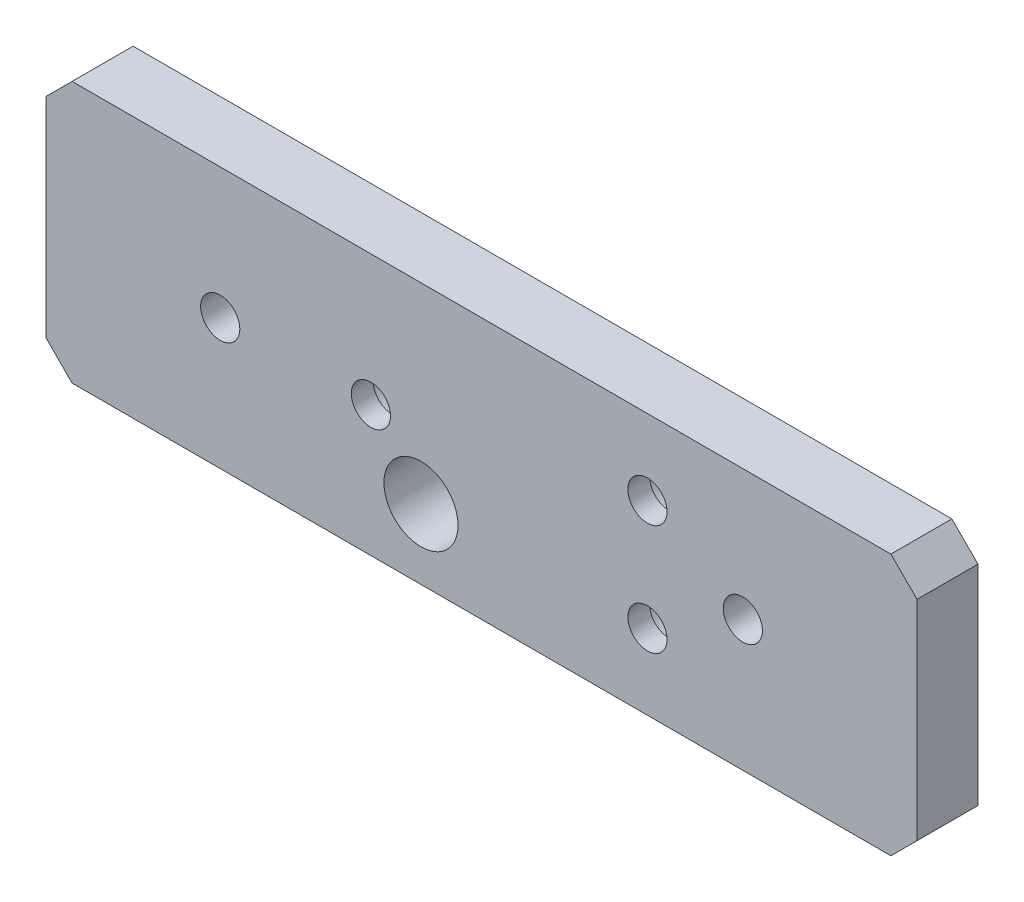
ISO-10303-21;
HEADER;
FILE_DESCRIPTION(('STEP AP214'),'2;1');
FILE_NAME('part.step','',(''),(''),'','','');
FILE_SCHEMA(('AUTOMOTIVE_DESIGN { 1 0 10303 214 1 1 1 1 }'));
ENDSEC;
DATA;
#1=APPLICATION_CONTEXT('core data for automotive mechanical design processes');
#2=APPLICATION_PROTOCOL_DEFINITION('international standard','automotive_design',2000,#1);
#3=PRODUCT_CONTEXT('',#1,'mechanical');
#4=PRODUCT('Part','Part','',(#3));
#5=PRODUCT_RELATED_PRODUCT_CATEGORY('part','',(#4));
#6=PRODUCT_DEFINITION_FORMATION('','',#4);
#7=PRODUCT_DEFINITION_CONTEXT('part definition',#1,'design');
#8=PRODUCT_DEFINITION('design','',#6,#7);
#9=PRODUCT_DEFINITION_SHAPE('','',#8);
#10=(LENGTH_UNIT() NAMED_UNIT(*) SI_UNIT(.MILLI.,.METRE.));
#11=(NAMED_UNIT(*) PLANE_ANGLE_UNIT() SI_UNIT($,.RADIAN.));
#12=(NAMED_UNIT(*) SI_UNIT($,.STERADIAN.) SOLID_ANGLE_UNIT());
#13=UNCERTAINTY_MEASURE_WITH_UNIT(LENGTH_MEASURE(1.E-05),#10,'distance_accuracy_value','');
#14=(GEOMETRIC_REPRESENTATION_CONTEXT(3) GLOBAL_UNCERTAINTY_ASSIGNED_CONTEXT((#13)) GLOBAL_UNIT_ASSIGNED_CONTEXT((#10,
#11,#12)) REPRESENTATION_CONTEXT('',''));
#15=CARTESIAN_POINT('',(0.,0.,0.));
#16=DIRECTION('',(0.,0.,1.));
#17=DIRECTION('',(1.,0.,0.));
#18=AXIS2_PLACEMENT_3D('',#15,#16,#17);
#19=CARTESIAN_POINT('',(91.2999999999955,-25.0000000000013,10.000000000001));
#20=DIRECTION('',(0.,0.,-1.));
#21=DIRECTION('',(-1.,0.,0.));
#22=AXIS2_PLACEMENT_3D('',#19,#20,#21);
#23=CYLINDRICAL_SURFACE('',#22,2.25);
#24=CARTESIAN_POINT('',(91.2999999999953,-25.0000000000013,7.00000000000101));
#25=DIRECTION('',(0.,0.,1.));
#26=DIRECTION('',(1.,0.,0.));
#27=AXIS2_PLACEMENT_3D('',#24,#25,#26);
#28=CIRCLE('',#27,2.25);
#29=CARTESIAN_POINT('',(93.5499999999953,-25.0000000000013,7.00000000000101));
#30=VERTEX_POINT('',#29);
#31=EDGE_CURVE('E145',#30,#30,#28,.T.);
#32=ORIENTED_EDGE('',*,*,#31,.T.);
#33=EDGE_LOOP('',(#32));
#34=FACE_BOUND('',#33,.T.);
#35=CARTESIAN_POINT('',(91.2999999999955,-25.0000000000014,4.50000000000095));
#36=DIRECTION('',(0.,0.,-1.));
#37=DIRECTION('',(-1.,0.,0.));
#38=AXIS2_PLACEMENT_3D('',#35,#36,#37);
#39=CIRCLE('',#38,2.25);
#40=CARTESIAN_POINT('',(89.0499999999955,-25.0000000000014,4.50000000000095));
#41=VERTEX_POINT('',#40);
#42=EDGE_CURVE('E143',#41,#41,#39,.F.);
#43=ORIENTED_EDGE('',*,*,#42,.F.);
#44=EDGE_LOOP('',(#43));
#45=FACE_BOUND('',#44,.T.);
#46=ADVANCED_FACE('F36',(#34,#45),#23,.F.);
#47=CARTESIAN_POINT('',(123.049999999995,-31.3500000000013,10.0000000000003));
#48=DIRECTION('',(0.,0.,-1.));
#49=DIRECTION('',(-1.,0.,0.));
#50=AXIS2_PLACEMENT_3D('',#47,#48,#49);
#51=CYLINDRICAL_SURFACE('',#50,2.25);
#52=CARTESIAN_POINT('',(123.049999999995,-31.3500000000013,7.00000000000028));
#53=DIRECTION('',(0.,0.,1.));
#54=DIRECTION('',(1.,0.,0.));
#55=AXIS2_PLACEMENT_3D('',#52,#53,#54);
#56=CIRCLE('',#55,2.25);
#57=CARTESIAN_POINT('',(125.299999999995,-31.3500000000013,7.00000000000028));
#58=VERTEX_POINT('',#57);
#59=EDGE_CURVE('E204',#58,#58,#56,.T.);
#60=ORIENTED_EDGE('',*,*,#59,.T.);
#61=EDGE_LOOP('',(#60));
#62=FACE_BOUND('',#61,.T.);
#63=CARTESIAN_POINT('',(123.049999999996,-31.3500000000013,4.50000000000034));
#64=DIRECTION('',(0.,0.,-1.));
#65=DIRECTION('',(-1.,0.,0.));
#66=AXIS2_PLACEMENT_3D('',#63,#64,#65);
#67=CIRCLE('',#66,2.25);
#68=CARTESIAN_POINT('',(120.799999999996,-31.3500000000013,4.50000000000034));
#69=VERTEX_POINT('',#68);
#70=EDGE_CURVE('E139',#69,#69,#67,.F.);
#71=ORIENTED_EDGE('',*,*,#70,.F.);
#72=EDGE_LOOP('',(#71));
#73=FACE_BOUND('',#72,.T.);
#74=ADVANCED_FACE('F239',(#62,#73),#51,.F.);
#75=CARTESIAN_POINT('',(123.049999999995,-18.6500000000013,10.000000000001));
#76=DIRECTION('',(0.,0.,-1.));
#77=DIRECTION('',(-1.,0.,0.));
#78=AXIS2_PLACEMENT_3D('',#75,#76,#77);
#79=CYLINDRICAL_SURFACE('',#78,2.25);
#80=CARTESIAN_POINT('',(123.049999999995,-18.6500000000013,7.00000000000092));
#81=DIRECTION('',(0.,0.,1.));
#82=DIRECTION('',(1.,0.,0.));
#83=AXIS2_PLACEMENT_3D('',#80,#81,#82);
#84=CIRCLE('',#83,2.25);
#85=CARTESIAN_POINT('',(125.299999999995,-18.6500000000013,7.00000000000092));
#86=VERTEX_POINT('',#85);
#87=EDGE_CURVE('E207',#86,#86,#84,.T.);
#88=ORIENTED_EDGE('',*,*,#87,.T.);
#89=EDGE_LOOP('',(#88));
#90=FACE_BOUND('',#89,.T.);
#91=CARTESIAN_POINT('',(123.049999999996,-18.6500000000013,4.50000000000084));
#92=DIRECTION('',(0.,0.,-1.));
#93=DIRECTION('',(-1.,0.,0.));
#94=AXIS2_PLACEMENT_3D('',#91,#92,#93);
#95=CIRCLE('',#94,2.25);
#96=CARTESIAN_POINT('',(120.799999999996,-18.6500000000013,4.50000000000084));
#97=VERTEX_POINT('',#96);
#98=EDGE_CURVE('E136',#97,#97,#95,.F.);
#99=ORIENTED_EDGE('',*,*,#98,.F.);
#100=EDGE_LOOP('',(#99));
#101=FACE_BOUND('',#100,.T.);
#102=ADVANCED_FACE('F232',(#90,#101),#79,.F.);
#103=CARTESIAN_POINT('',(164.000000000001,-40.0000000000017,7.00000000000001));
#104=DIRECTION('',(0.,1.,0.));
#105=DIRECTION('',(0.,0.,1.));
#106=AXIS2_PLACEMENT_3D('',#103,#104,#105);
#107=PLANE('',#106);
#108=DIRECTION('',(1.,0.,0.));
#109=VECTOR('',#108,1.);
#110=CARTESIAN_POINT('',(164.000000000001,-40.0000000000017,7.00000000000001));
#111=LINE('',#110,#109);
#112=CARTESIAN_POINT('',(57.0000000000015,-40.0000000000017,7.00000000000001));
#113=VERTEX_POINT('',#112);
#114=CARTESIAN_POINT('',(151.000000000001,-40.0000000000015,7.00000000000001));
#115=VERTEX_POINT('',#114);
#116=EDGE_CURVE('E118',#113,#115,#111,.T.);
#117=ORIENTED_EDGE('',*,*,#116,.F.);
#118=DIRECTION('',(0.,0.,-1.));
#119=VECTOR('',#118,1.);
#120=CARTESIAN_POINT('',(57.0000000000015,-40.0000000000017,7.00000000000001));
#121=LINE('',#120,#119);
#122=CARTESIAN_POINT('',(57.0000000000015,-40.0000000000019,0.));
#123=VERTEX_POINT('',#122);
#124=EDGE_CURVE('E165',#113,#123,#121,.T.);
#125=ORIENTED_EDGE('',*,*,#124,.T.);
#126=DIRECTION('',(1.,0.,0.));
#127=VECTOR('',#126,1.);
#128=CARTESIAN_POINT('',(164.000000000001,-40.0000000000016,0.));
#129=LINE('',#128,#127);
#130=CARTESIAN_POINT('',(151.000000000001,-40.0000000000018,0.));
#131=VERTEX_POINT('',#130);
#132=EDGE_CURVE('E126',#123,#131,#129,.T.);
#133=ORIENTED_EDGE('',*,*,#132,.T.);
#134=DIRECTION('',(0.,0.,1.));
#135=VECTOR('',#134,1.);
#136=CARTESIAN_POINT('',(151.000000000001,-40.0000000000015,7.00000000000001));
#137=LINE('',#136,#135);
#138=EDGE_CURVE('E163',#131,#115,#137,.T.);
#139=ORIENTED_EDGE('',*,*,#138,.T.);
#140=EDGE_LOOP('',(#117,#125,#133,#139));
#141=FACE_BOUND('',#140,.T.);
#142=ADVANCED_FACE('F223',(#141),#107,.F.);
#143=CARTESIAN_POINT('',(0.,2.63677968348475E-13,7.00000000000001));
#144=DIRECTION('',(0.,0.,1.));
#145=DIRECTION('',(1.,0.,0.));
#146=AXIS2_PLACEMENT_3D('',#143,#144,#145);
#147=PLANE('',#146);
#148=CARTESIAN_POINT('',(97.0499999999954,-32.0000000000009,6.9999999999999));
#149=DIRECTION('',(0.,0.,1.));
#150=DIRECTION('',(1.,0.,0.));
#151=AXIS2_PLACEMENT_3D('',#148,#149,#150);
#152=CIRCLE('',#151,4.25);
#153=CARTESIAN_POINT('',(101.299999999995,-32.0000000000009,6.9999999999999));
#154=VERTEX_POINT('',#153);
#155=EDGE_CURVE('E175',#154,#154,#152,.T.);
#156=ORIENTED_EDGE('',*,*,#155,.F.);
#157=EDGE_LOOP('',(#156));
#158=FACE_BOUND('',#157,.T.);
#159=DIRECTION('',(-1.,0.,0.));
#160=VECTOR('',#159,1.);
#161=CARTESIAN_POINT('',(164.000000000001,-10.0000000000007,7.00000000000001));
#162=LINE('',#161,#160);
#163=CARTESIAN_POINT('',(151.000000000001,-10.0000000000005,7.00000000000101));
#164=VERTEX_POINT('',#163);
#165=CARTESIAN_POINT('',(57.0000000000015,-10.0000000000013,7.00000000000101));
#166=VERTEX_POINT('',#165);
#167=EDGE_CURVE('E116',#164,#166,#162,.T.);
#168=ORIENTED_EDGE('',*,*,#167,.T.);
#169=DIRECTION('',(0.707106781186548,0.707106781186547,0.));
#170=VECTOR('',#169,1.);
#171=CARTESIAN_POINT('',(33.5000000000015,-33.5000000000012,7.00000000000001));
#172=LINE('',#171,#170);
#173=CARTESIAN_POINT('',(54.0000000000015,-13.0000000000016,7.00000000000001));
#174=VERTEX_POINT('',#173);
#175=EDGE_CURVE('E154',#166,#174,#172,.F.);
#176=ORIENTED_EDGE('',*,*,#175,.T.);
#177=DIRECTION('',(0.,-1.,0.));
#178=VECTOR('',#177,1.);
#179=CARTESIAN_POINT('',(54.0000000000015,11.6718739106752,7.00000000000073));
#180=LINE('',#179,#178);
#181=CARTESIAN_POINT('',(54.0000000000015,-37.0000000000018,7.00000000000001));
#182=VERTEX_POINT('',#181);
#183=EDGE_CURVE('E197',#174,#182,#180,.T.);
#184=ORIENTED_EDGE('',*,*,#183,.T.);
#185=DIRECTION('',(-0.707106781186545,0.70710678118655,0.));
#186=VECTOR('',#185,1.);
#187=CARTESIAN_POINT('',(8.49999999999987,8.5000000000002,7.00000000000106));
#188=LINE('',#187,#186);
#189=EDGE_CURVE('E152',#182,#113,#188,.F.);
#190=ORIENTED_EDGE('',*,*,#189,.T.);
#191=ORIENTED_EDGE('',*,*,#116,.T.);
#192=DIRECTION('',(-0.707106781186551,-0.707106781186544,0.));
#193=VECTOR('',#192,1.);
#194=CARTESIAN_POINT('',(95.5000000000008,-95.500000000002,7.00000000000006));
#195=LINE('',#194,#193);
#196=CARTESIAN_POINT('',(154.000000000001,-37.0000000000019,7.00000000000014));
#197=VERTEX_POINT('',#196);
#198=EDGE_CURVE('E148',#115,#197,#195,.F.);
#199=ORIENTED_EDGE('',*,*,#198,.T.);
#200=DIRECTION('',(0.,1.,0.));
#201=VECTOR('',#200,1.);
#202=CARTESIAN_POINT('',(154.000000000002,-10.0000000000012,7.00000000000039));
#203=LINE('',#202,#201);
#204=CARTESIAN_POINT('',(154.000000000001,-13.0000000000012,7.00000000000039));
#205=VERTEX_POINT('',#204);
#206=EDGE_CURVE('E172',#197,#205,#203,.T.);
#207=ORIENTED_EDGE('',*,*,#206,.T.);
#208=DIRECTION('',(0.707106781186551,-0.707106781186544,0.));
#209=VECTOR('',#208,1.);
#210=CARTESIAN_POINT('',(70.4999999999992,70.5000000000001,7.00000000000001));
#211=LINE('',#210,#209);
#212=EDGE_CURVE('E150',#205,#164,#211,.F.);
#213=ORIENTED_EDGE('',*,*,#212,.T.);
#214=EDGE_LOOP('',(#168,#176,#184,#190,#191,#199,#207,#213));
#215=FACE_BOUND('',#214,.T.);
#216=ORIENTED_EDGE('',*,*,#87,.F.);
#217=EDGE_LOOP('',(#216));
#218=FACE_BOUND('',#217,.T.);
#219=ORIENTED_EDGE('',*,*,#59,.F.);
#220=EDGE_LOOP('',(#219));
#221=FACE_BOUND('',#220,.T.);
#222=ORIENTED_EDGE('',*,*,#31,.F.);
#223=EDGE_LOOP('',(#222));
#224=FACE_BOUND('',#223,.T.);
#225=CARTESIAN_POINT('',(133.999999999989,-25.0000000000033,7.00000000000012));
#226=DIRECTION('',(0.,0.,1.));
#227=DIRECTION('',(1.,0.,0.));
#228=AXIS2_PLACEMENT_3D('',#225,#226,#227);
#229=CIRCLE('',#228,2.24999999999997);
#230=CARTESIAN_POINT('',(136.249999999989,-25.0000000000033,7.00000000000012));
#231=VERTEX_POINT('',#230);
#232=EDGE_CURVE('E210',#231,#231,#229,.T.);
#233=ORIENTED_EDGE('',*,*,#232,.F.);
#234=EDGE_LOOP('',(#233));
#235=FACE_BOUND('',#234,.T.);
#236=CARTESIAN_POINT('',(73.9999999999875,-25.0000000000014,7.00000000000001));
#237=DIRECTION('',(0.,0.,1.));
#238=DIRECTION('',(1.,0.,0.));
#239=AXIS2_PLACEMENT_3D('',#236,#237,#238);
#240=CIRCLE('',#239,2.24999999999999);
#241=CARTESIAN_POINT('',(76.2499999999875,-25.0000000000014,7.00000000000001));
#242=VERTEX_POINT('',#241);
#243=EDGE_CURVE('E129',#242,#242,#240,.T.);
#244=ORIENTED_EDGE('',*,*,#243,.F.);
#245=EDGE_LOOP('',(#244));
#246=FACE_BOUND('',#245,.T.);
#247=ADVANCED_FACE('F221',(#158,#215,#218,#221,#224,#235,#246),#147,.T.);
#248=CARTESIAN_POINT('',(0.,0.,0.));
#249=DIRECTION('',(0.,0.,1.));
#250=DIRECTION('',(1.,0.,0.));
#251=AXIS2_PLACEMENT_3D('',#248,#249,#250);
#252=PLANE('',#251);
#253=CARTESIAN_POINT('',(97.0499999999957,-32.0000000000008,0.));
#254=DIRECTION('',(0.,0.,-1.));
#255=DIRECTION('',(-1.,0.,0.));
#256=AXIS2_PLACEMENT_3D('',#253,#254,#255);
#257=CIRCLE('',#256,4.25);
#258=CARTESIAN_POINT('',(92.7999999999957,-32.0000000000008,0.));
#259=VERTEX_POINT('',#258);
#260=EDGE_CURVE('E180',#259,#259,#257,.T.);
#261=ORIENTED_EDGE('',*,*,#260,.F.);
#262=EDGE_LOOP('',(#261));
#263=FACE_BOUND('',#262,.T.);
#264=CARTESIAN_POINT('',(91.2999999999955,-25.0000000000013,9.99200722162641E-13));
#265=DIRECTION('',(0.,0.,-1.));
#266=DIRECTION('',(-1.,0.,0.));
#267=AXIS2_PLACEMENT_3D('',#264,#265,#266);
#268=CIRCLE('',#267,4.00000000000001);
#269=CARTESIAN_POINT('',(87.2999999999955,-25.0000000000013,9.99200722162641E-13));
#270=VERTEX_POINT('',#269);
#271=EDGE_CURVE('E194',#270,#270,#268,.T.);
#272=ORIENTED_EDGE('',*,*,#271,.F.);
#273=EDGE_LOOP('',(#272));
#274=FACE_BOUND('',#273,.T.);
#275=CARTESIAN_POINT('',(123.049999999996,-18.6500000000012,8.88178419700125E-13));
#276=DIRECTION('',(0.,0.,-1.));
#277=DIRECTION('',(-1.,0.,0.));
#278=AXIS2_PLACEMENT_3D('',#275,#276,#277);
#279=CIRCLE('',#278,3.99999999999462);
#280=CARTESIAN_POINT('',(119.050000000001,-18.6500000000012,8.88178419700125E-13));
#281=VERTEX_POINT('',#280);
#282=EDGE_CURVE('E188',#281,#281,#279,.T.);
#283=ORIENTED_EDGE('',*,*,#282,.F.);
#284=EDGE_LOOP('',(#283));
#285=FACE_BOUND('',#284,.T.);
#286=CARTESIAN_POINT('',(123.049999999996,-31.3500000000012,2.77555756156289E-13));
#287=DIRECTION('',(0.,0.,-1.));
#288=DIRECTION('',(-1.,0.,0.));
#289=AXIS2_PLACEMENT_3D('',#286,#287,#288);
#290=CIRCLE('',#289,3.99999999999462);
#291=CARTESIAN_POINT('',(119.050000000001,-31.3500000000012,2.77555756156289E-13));
#292=VERTEX_POINT('',#291);
#293=EDGE_CURVE('E187',#292,#292,#290,.T.);
#294=ORIENTED_EDGE('',*,*,#293,.F.);
#295=EDGE_LOOP('',(#294));
#296=FACE_BOUND('',#295,.T.);
#297=CARTESIAN_POINT('',(133.999999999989,-25.0000000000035,1.11022302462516E-13));
#298=DIRECTION('',(0.,0.,1.));
#299=DIRECTION('',(1.,0.,0.));
#300=AXIS2_PLACEMENT_3D('',#297,#298,#299);
#301=CIRCLE('',#300,2.25);
#302=CARTESIAN_POINT('',(136.249999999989,-25.0000000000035,1.11022302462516E-13));
#303=VERTEX_POINT('',#302);
#304=EDGE_CURVE('E213',#303,#303,#301,.T.);
#305=ORIENTED_EDGE('',*,*,#304,.T.);
#306=EDGE_LOOP('',(#305));
#307=FACE_BOUND('',#306,.T.);
#308=CARTESIAN_POINT('',(73.9999999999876,-25.0000000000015,0.));
#309=DIRECTION('',(0.,0.,1.));
#310=DIRECTION('',(1.,0.,0.));
#311=AXIS2_PLACEMENT_3D('',#308,#309,#310);
#312=CIRCLE('',#311,2.25);
#313=CARTESIAN_POINT('',(76.2499999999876,-25.0000000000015,0.));
#314=VERTEX_POINT('',#313);
#315=EDGE_CURVE('E124',#314,#314,#312,.T.);
#316=ORIENTED_EDGE('',*,*,#315,.T.);
#317=EDGE_LOOP('',(#316));
#318=FACE_BOUND('',#317,.T.);
#319=DIRECTION('',(0.,-1.,0.));
#320=VECTOR('',#319,1.);
#321=CARTESIAN_POINT('',(54.0000000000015,11.6718739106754,7.21644966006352E-13));
#322=LINE('',#321,#320);
#323=CARTESIAN_POINT('',(54.0000000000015,-13.0000000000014,0.));
#324=VERTEX_POINT('',#323);
#325=CARTESIAN_POINT('',(54.0000000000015,-37.0000000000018,0.));
#326=VERTEX_POINT('',#325);
#327=EDGE_CURVE('E177',#324,#326,#322,.T.);
#328=ORIENTED_EDGE('',*,*,#327,.F.);
#329=DIRECTION('',(-0.707106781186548,-0.707106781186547,0.));
#330=VECTOR('',#329,1.);
#331=CARTESIAN_POINT('',(57.0000000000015,-10.0000000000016,9.99200722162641E-13));
#332=LINE('',#331,#330);
#333=CARTESIAN_POINT('',(57.0000000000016,-10.0000000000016,9.99200722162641E-13));
#334=VERTEX_POINT('',#333);
#335=EDGE_CURVE('E123',#324,#334,#332,.F.);
#336=ORIENTED_EDGE('',*,*,#335,.T.);
#337=DIRECTION('',(-1.,0.,0.));
#338=VECTOR('',#337,1.);
#339=CARTESIAN_POINT('',(164.000000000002,-10.0000000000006,0.));
#340=LINE('',#339,#338);
#341=CARTESIAN_POINT('',(151.000000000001,-10.0000000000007,9.99200722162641E-13));
#342=VERTEX_POINT('',#341);
#343=EDGE_CURVE('E113',#342,#334,#340,.T.);
#344=ORIENTED_EDGE('',*,*,#343,.F.);
#345=DIRECTION('',(-0.707106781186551,0.707106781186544,0.));
#346=VECTOR('',#345,1.);
#347=CARTESIAN_POINT('',(151.000000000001,-10.0000000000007,9.99200722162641E-13));
#348=LINE('',#347,#346);
#349=CARTESIAN_POINT('',(154.000000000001,-13.0000000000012,3.88578058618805E-13));
#350=VERTEX_POINT('',#349);
#351=EDGE_CURVE('E51',#342,#350,#348,.F.);
#352=ORIENTED_EDGE('',*,*,#351,.T.);
#353=DIRECTION('',(0.,1.,0.));
#354=VECTOR('',#353,1.);
#355=CARTESIAN_POINT('',(154.000000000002,-10.0000000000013,3.88578058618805E-13));
#356=LINE('',#355,#354);
#357=CARTESIAN_POINT('',(154.000000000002,-37.000000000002,1.38777878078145E-13));
#358=VERTEX_POINT('',#357);
#359=EDGE_CURVE('E170',#358,#350,#356,.T.);
#360=ORIENTED_EDGE('',*,*,#359,.F.);
#361=DIRECTION('',(0.707106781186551,0.707106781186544,0.));
#362=VECTOR('',#361,1.);
#363=CARTESIAN_POINT('',(154.000000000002,-37.000000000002,1.38777878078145E-13));
#364=LINE('',#363,#362);
#365=EDGE_CURVE('E59',#358,#131,#364,.F.);
#366=ORIENTED_EDGE('',*,*,#365,.T.);
#367=ORIENTED_EDGE('',*,*,#132,.F.);
#368=DIRECTION('',(0.707106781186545,-0.70710678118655,0.));
#369=VECTOR('',#368,1.);
#370=CARTESIAN_POINT('',(57.0000000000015,-40.0000000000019,0.));
#371=LINE('',#370,#369);
#372=EDGE_CURVE('E106',#123,#326,#371,.F.);
#373=ORIENTED_EDGE('',*,*,#372,.T.);
#374=EDGE_LOOP('',(#328,#336,#344,#352,#360,#366,#367,#373));
#375=FACE_BOUND('',#374,.T.);
#376=ADVANCED_FACE('F121',(#263,#274,#285,#296,#307,#318,#375),#252,.F.);
#377=CARTESIAN_POINT('',(164.000000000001,-10.0000000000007,7.00000000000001));
#378=DIRECTION('',(0.,-1.,0.));
#379=DIRECTION('',(1.,0.,0.));
#380=AXIS2_PLACEMENT_3D('',#377,#378,#379);
#381=PLANE('',#380);
#382=ORIENTED_EDGE('',*,*,#343,.T.);
#383=DIRECTION('',(0.,0.,1.));
#384=VECTOR('',#383,1.);
#385=CARTESIAN_POINT('',(57.0000000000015,-10.0000000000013,7.00000000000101));
#386=LINE('',#385,#384);
#387=EDGE_CURVE('E117',#334,#166,#386,.T.);
#388=ORIENTED_EDGE('',*,*,#387,.T.);
#389=ORIENTED_EDGE('',*,*,#167,.F.);
#390=DIRECTION('',(0.,0.,-1.));
#391=VECTOR('',#390,1.);
#392=CARTESIAN_POINT('',(151.000000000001,-10.0000000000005,7.00000000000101));
#393=LINE('',#392,#391);
#394=EDGE_CURVE('E105',#164,#342,#393,.T.);
#395=ORIENTED_EDGE('',*,*,#394,.T.);
#396=EDGE_LOOP('',(#382,#388,#389,#395));
#397=FACE_BOUND('',#396,.T.);
#398=ADVANCED_FACE('F111',(#397),#381,.F.);
#399=CARTESIAN_POINT('',(73.9999999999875,-25.0000000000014,7.00000000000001));
#400=DIRECTION('',(0.,0.,1.));
#401=DIRECTION('',(1.,0.,0.));
#402=AXIS2_PLACEMENT_3D('',#399,#400,#401);
#403=CYLINDRICAL_SURFACE('',#402,2.25);
#404=ORIENTED_EDGE('',*,*,#315,.F.);
#405=EDGE_LOOP('',(#404));
#406=FACE_BOUND('',#405,.T.);
#407=ORIENTED_EDGE('',*,*,#243,.T.);
#408=EDGE_LOOP('',(#407));
#409=FACE_BOUND('',#408,.T.);
#410=ADVANCED_FACE('F219',(#406,#409),#403,.F.);
#411=CARTESIAN_POINT('',(133.999999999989,-25.0000000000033,7.00000000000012));
#412=DIRECTION('',(0.,0.,1.));
#413=DIRECTION('',(1.,0.,0.));
#414=AXIS2_PLACEMENT_3D('',#411,#412,#413);
#415=CYLINDRICAL_SURFACE('',#414,2.24999999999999);
#416=ORIENTED_EDGE('',*,*,#304,.F.);
#417=EDGE_LOOP('',(#416));
#418=FACE_BOUND('',#417,.T.);
#419=ORIENTED_EDGE('',*,*,#232,.T.);
#420=EDGE_LOOP('',(#419));
#421=FACE_BOUND('',#420,.T.);
#422=ADVANCED_FACE('F250',(#418,#421),#415,.F.);
#423=CARTESIAN_POINT('',(123.049999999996,-18.6500000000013,4.50000000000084));
#424=DIRECTION('',(0.,0.,-1.));
#425=DIRECTION('',(-1.,0.,0.));
#426=AXIS2_PLACEMENT_3D('',#423,#424,#425);
#427=PLANE('',#426);
#428=CARTESIAN_POINT('',(123.049999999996,-18.6500000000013,4.50000000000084));
#429=DIRECTION('',(0.,0.,-1.));
#430=DIRECTION('',(-1.,0.,0.));
#431=AXIS2_PLACEMENT_3D('',#428,#429,#430);
#432=CIRCLE('',#431,3.99999999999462);
#433=CARTESIAN_POINT('',(119.050000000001,-18.6500000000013,4.50000000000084));
#434=VERTEX_POINT('',#433);
#435=EDGE_CURVE('E184',#434,#434,#432,.T.);
#436=ORIENTED_EDGE('',*,*,#435,.T.);
#437=EDGE_LOOP('',(#436));
#438=FACE_BOUND('',#437,.T.);
#439=ORIENTED_EDGE('',*,*,#98,.T.);
#440=EDGE_LOOP('',(#439));
#441=FACE_BOUND('',#440,.T.);
#442=ADVANCED_FACE('F253',(#438,#441),#427,.T.);
#443=CARTESIAN_POINT('',(123.049999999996,-18.6500000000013,4.50000000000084));
#444=DIRECTION('',(0.,0.,-1.));
#445=DIRECTION('',(-1.,0.,0.));
#446=AXIS2_PLACEMENT_3D('',#443,#444,#445);
#447=CYLINDRICAL_SURFACE('',#446,3.99999999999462);
#448=ORIENTED_EDGE('',*,*,#435,.F.);
#449=EDGE_LOOP('',(#448));
#450=FACE_BOUND('',#449,.T.);
#451=ORIENTED_EDGE('',*,*,#282,.T.);
#452=EDGE_LOOP('',(#451));
#453=FACE_BOUND('',#452,.T.);
#454=ADVANCED_FACE('F276',(#450,#453),#447,.F.);
#455=CARTESIAN_POINT('',(123.049999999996,-31.3500000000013,4.50000000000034));
#456=DIRECTION('',(0.,0.,-1.));
#457=DIRECTION('',(-1.,0.,0.));
#458=AXIS2_PLACEMENT_3D('',#455,#456,#457);
#459=PLANE('',#458);
#460=CARTESIAN_POINT('',(123.049999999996,-31.3500000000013,4.50000000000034));
#461=DIRECTION('',(0.,0.,-1.));
#462=DIRECTION('',(-1.,0.,0.));
#463=AXIS2_PLACEMENT_3D('',#460,#461,#462);
#464=CIRCLE('',#463,3.99999999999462);
#465=CARTESIAN_POINT('',(119.050000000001,-31.3500000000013,4.50000000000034));
#466=VERTEX_POINT('',#465);
#467=EDGE_CURVE('E140',#466,#466,#464,.T.);
#468=ORIENTED_EDGE('',*,*,#467,.T.);
#469=EDGE_LOOP('',(#468));
#470=FACE_BOUND('',#469,.T.);
#471=ORIENTED_EDGE('',*,*,#70,.T.);
#472=EDGE_LOOP('',(#471));
#473=FACE_BOUND('',#472,.T.);
#474=ADVANCED_FACE('F284',(#470,#473),#459,.T.);
#475=CARTESIAN_POINT('',(123.049999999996,-31.3500000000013,4.50000000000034));
#476=DIRECTION('',(0.,0.,-1.));
#477=DIRECTION('',(-1.,0.,0.));
#478=AXIS2_PLACEMENT_3D('',#475,#476,#477);
#479=CYLINDRICAL_SURFACE('',#478,3.99999999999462);
#480=ORIENTED_EDGE('',*,*,#467,.F.);
#481=EDGE_LOOP('',(#480));
#482=FACE_BOUND('',#481,.T.);
#483=ORIENTED_EDGE('',*,*,#293,.T.);
#484=EDGE_LOOP('',(#483));
#485=FACE_BOUND('',#484,.T.);
#486=ADVANCED_FACE('F292',(#482,#485),#479,.F.);
#487=CARTESIAN_POINT('',(91.2999999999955,-25.0000000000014,4.50000000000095));
#488=DIRECTION('',(0.,0.,-1.));
#489=DIRECTION('',(-1.,0.,0.));
#490=AXIS2_PLACEMENT_3D('',#487,#488,#489);
#491=PLANE('',#490);
#492=CARTESIAN_POINT('',(91.2999999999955,-25.0000000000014,4.50000000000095));
#493=DIRECTION('',(0.,0.,-1.));
#494=DIRECTION('',(-1.,0.,0.));
#495=AXIS2_PLACEMENT_3D('',#492,#493,#494);
#496=CIRCLE('',#495,4.00000000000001);
#497=CARTESIAN_POINT('',(87.2999999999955,-25.0000000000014,4.50000000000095));
#498=VERTEX_POINT('',#497);
#499=EDGE_CURVE('E191',#498,#498,#496,.T.);
#500=ORIENTED_EDGE('',*,*,#499,.T.);
#501=EDGE_LOOP('',(#500));
#502=FACE_BOUND('',#501,.T.);
#503=ORIENTED_EDGE('',*,*,#42,.T.);
#504=EDGE_LOOP('',(#503));
#505=FACE_BOUND('',#504,.T.);
#506=ADVANCED_FACE('F300',(#502,#505),#491,.T.);
#507=CARTESIAN_POINT('',(91.2999999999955,-25.0000000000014,4.50000000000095));
#508=DIRECTION('',(0.,0.,-1.));
#509=DIRECTION('',(-1.,0.,0.));
#510=AXIS2_PLACEMENT_3D('',#507,#508,#509);
#511=CYLINDRICAL_SURFACE('',#510,4.00000000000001);
#512=ORIENTED_EDGE('',*,*,#499,.F.);
#513=EDGE_LOOP('',(#512));
#514=FACE_BOUND('',#513,.T.);
#515=ORIENTED_EDGE('',*,*,#271,.T.);
#516=EDGE_LOOP('',(#515));
#517=FACE_BOUND('',#516,.T.);
#518=ADVANCED_FACE('F308',(#514,#517),#511,.F.);
#519=CARTESIAN_POINT('',(154.000000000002,-10.0000000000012,7.00000000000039));
#520=DIRECTION('',(-1.,0.,0.));
#521=DIRECTION('',(0.,0.,1.));
#522=AXIS2_PLACEMENT_3D('',#519,#520,#521);
#523=PLANE('',#522);
#524=ORIENTED_EDGE('',*,*,#359,.T.);
#525=DIRECTION('',(0.,0.,1.));
#526=VECTOR('',#525,1.);
#527=CARTESIAN_POINT('',(154.000000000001,-13.0000000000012,7.00000000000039));
#528=LINE('',#527,#526);
#529=EDGE_CURVE('E11',#350,#205,#528,.T.);
#530=ORIENTED_EDGE('',*,*,#529,.T.);
#531=ORIENTED_EDGE('',*,*,#206,.F.);
#532=DIRECTION('',(0.,0.,-1.));
#533=VECTOR('',#532,1.);
#534=CARTESIAN_POINT('',(154.000000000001,-37.0000000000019,7.00000000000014));
#535=LINE('',#534,#533);
#536=EDGE_CURVE('E44',#197,#358,#535,.T.);
#537=ORIENTED_EDGE('',*,*,#536,.T.);
#538=EDGE_LOOP('',(#524,#530,#531,#537));
#539=FACE_BOUND('',#538,.T.);
#540=ADVANCED_FACE('F169',(#539),#523,.F.);
#541=CARTESIAN_POINT('',(54.0000000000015,11.6718739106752,7.00000000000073));
#542=DIRECTION('',(1.,0.,0.));
#543=DIRECTION('',(0.,1.,0.));
#544=AXIS2_PLACEMENT_3D('',#541,#542,#543);
#545=PLANE('',#544);
#546=ORIENTED_EDGE('',*,*,#183,.F.);
#547=DIRECTION('',(0.,0.,-1.));
#548=VECTOR('',#547,1.);
#549=CARTESIAN_POINT('',(54.0000000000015,-13.0000000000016,7.00000000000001));
#550=LINE('',#549,#548);
#551=EDGE_CURVE('E158',#174,#324,#550,.T.);
#552=ORIENTED_EDGE('',*,*,#551,.T.);
#553=ORIENTED_EDGE('',*,*,#327,.T.);
#554=DIRECTION('',(0.,0.,1.));
#555=VECTOR('',#554,1.);
#556=CARTESIAN_POINT('',(54.0000000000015,-37.0000000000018,7.00000000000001));
#557=LINE('',#556,#555);
#558=EDGE_CURVE('E156',#326,#182,#557,.T.);
#559=ORIENTED_EDGE('',*,*,#558,.T.);
#560=EDGE_LOOP('',(#546,#552,#553,#559));
#561=FACE_BOUND('',#560,.T.);
#562=ADVANCED_FACE('F323',(#561),#545,.F.);
#563=CARTESIAN_POINT('',(57.0000000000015,-10.0000000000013,7.00000000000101));
#564=DIRECTION('',(0.707106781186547,-0.707106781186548,0.));
#565=DIRECTION('',(0.,0.,1.));
#566=AXIS2_PLACEMENT_3D('',#563,#564,#565);
#567=PLANE('',#566);
#568=ORIENTED_EDGE('',*,*,#335,.F.);
#569=ORIENTED_EDGE('',*,*,#551,.F.);
#570=ORIENTED_EDGE('',*,*,#175,.F.);
#571=ORIENTED_EDGE('',*,*,#387,.F.);
#572=EDGE_LOOP('',(#568,#569,#570,#571));
#573=FACE_BOUND('',#572,.T.);
#574=ADVANCED_FACE('F330',(#573),#567,.F.);
#575=CARTESIAN_POINT('',(57.0000000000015,-40.0000000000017,7.00000000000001));
#576=DIRECTION('',(0.70710678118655,0.707106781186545,0.));
#577=DIRECTION('',(0.,0.,-1.));
#578=AXIS2_PLACEMENT_3D('',#575,#576,#577);
#579=PLANE('',#578);
#580=ORIENTED_EDGE('',*,*,#189,.F.);
#581=ORIENTED_EDGE('',*,*,#558,.F.);
#582=ORIENTED_EDGE('',*,*,#372,.F.);
#583=ORIENTED_EDGE('',*,*,#124,.F.);
#584=EDGE_LOOP('',(#580,#581,#582,#583));
#585=FACE_BOUND('',#584,.T.);
#586=ADVANCED_FACE('F338',(#585),#579,.F.);
#587=CARTESIAN_POINT('',(151.000000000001,-10.0000000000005,7.00000000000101));
#588=DIRECTION('',(-0.707106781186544,-0.707106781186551,0.));
#589=DIRECTION('',(0.,0.,-1.));
#590=AXIS2_PLACEMENT_3D('',#587,#588,#589);
#591=PLANE('',#590);
#592=ORIENTED_EDGE('',*,*,#212,.F.);
#593=ORIENTED_EDGE('',*,*,#529,.F.);
#594=ORIENTED_EDGE('',*,*,#351,.F.);
#595=ORIENTED_EDGE('',*,*,#394,.F.);
#596=EDGE_LOOP('',(#592,#593,#594,#595));
#597=FACE_BOUND('',#596,.T.);
#598=ADVANCED_FACE('F104',(#597),#591,.F.);
#599=CARTESIAN_POINT('',(154.000000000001,-37.0000000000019,7.00000000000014));
#600=DIRECTION('',(-0.707106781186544,0.707106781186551,0.));
#601=DIRECTION('',(0.,0.,-1.));
#602=AXIS2_PLACEMENT_3D('',#599,#600,#601);
#603=PLANE('',#602);
#604=ORIENTED_EDGE('',*,*,#198,.F.);
#605=ORIENTED_EDGE('',*,*,#138,.F.);
#606=ORIENTED_EDGE('',*,*,#365,.F.);
#607=ORIENTED_EDGE('',*,*,#536,.F.);
#608=EDGE_LOOP('',(#604,#605,#606,#607));
#609=FACE_BOUND('',#608,.T.);
#610=ADVANCED_FACE('F38',(#609),#603,.F.);
#611=CARTESIAN_POINT('',(97.0499999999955,-32.0000000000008,9.9999999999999));
#612=DIRECTION('',(0.,0.,-1.));
#613=DIRECTION('',(-1.,0.,0.));
#614=AXIS2_PLACEMENT_3D('',#611,#612,#613);
#615=CYLINDRICAL_SURFACE('',#614,4.25);
#616=ORIENTED_EDGE('',*,*,#155,.T.);
#617=EDGE_LOOP('',(#616));
#618=FACE_BOUND('',#617,.T.);
#619=ORIENTED_EDGE('',*,*,#260,.T.);
#620=EDGE_LOOP('',(#619));
#621=FACE_BOUND('',#620,.T.);
#622=ADVANCED_FACE('F358',(#618,#621),#615,.F.);
#623=CLOSED_SHELL('',(#46,#74,#102,#142,#247,#376,#398,#410,#422,#442,#454,#474,#486,#506,#518,
#540,#562,#574,#586,#598,#610,#622));
#624=MANIFOLD_SOLID_BREP('B2',#623);
#625=ADVANCED_BREP_SHAPE_REPRESENTATION('',(#18,#624),#14);
#626=SHAPE_DEFINITION_REPRESENTATION(#9,#625);
ENDSEC;
END-ISO-10303-21;
